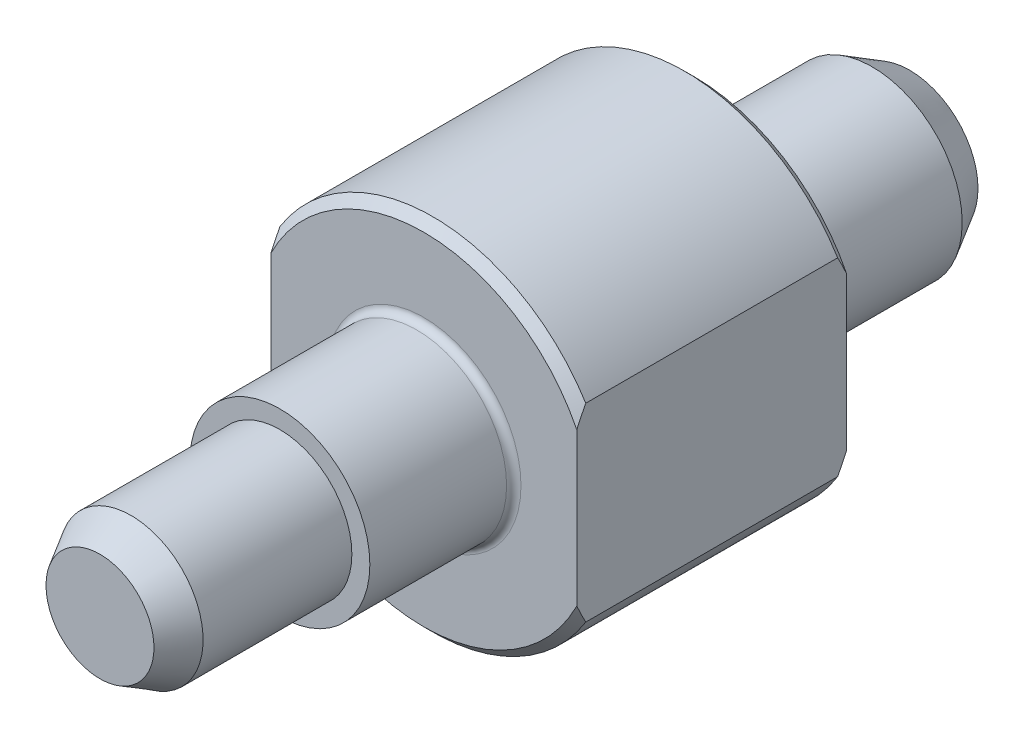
ISO-10303-21;
HEADER;
FILE_DESCRIPTION(('STEP AP214'),'2;1');
FILE_NAME('part.step','',(''),(''),'','','');
FILE_SCHEMA(('AUTOMOTIVE_DESIGN { 1 0 10303 214 1 1 1 1 }'));
ENDSEC;
DATA;
#1=APPLICATION_CONTEXT('core data for automotive mechanical design processes');
#2=APPLICATION_PROTOCOL_DEFINITION('international standard','automotive_design',2000,#1);
#3=PRODUCT_CONTEXT('',#1,'mechanical');
#4=PRODUCT('Part','Part','',(#3));
#5=PRODUCT_RELATED_PRODUCT_CATEGORY('part','',(#4));
#6=PRODUCT_DEFINITION_FORMATION('','',#4);
#7=PRODUCT_DEFINITION_CONTEXT('part definition',#1,'design');
#8=PRODUCT_DEFINITION('design','',#6,#7);
#9=PRODUCT_DEFINITION_SHAPE('','',#8);
#10=(LENGTH_UNIT() NAMED_UNIT(*) SI_UNIT(.MILLI.,.METRE.));
#11=(NAMED_UNIT(*) PLANE_ANGLE_UNIT() SI_UNIT($,.RADIAN.));
#12=(NAMED_UNIT(*) SI_UNIT($,.STERADIAN.) SOLID_ANGLE_UNIT());
#13=UNCERTAINTY_MEASURE_WITH_UNIT(LENGTH_MEASURE(1.E-05),#10,'distance_accuracy_value','');
#14=(GEOMETRIC_REPRESENTATION_CONTEXT(3) GLOBAL_UNCERTAINTY_ASSIGNED_CONTEXT((#13)) GLOBAL_UNIT_ASSIGNED_CONTEXT((#10,
#11,#12)) REPRESENTATION_CONTEXT('',''));
#15=CARTESIAN_POINT('',(0.,0.,0.));
#16=DIRECTION('',(0.,0.,1.));
#17=DIRECTION('',(1.,0.,0.));
#18=AXIS2_PLACEMENT_3D('',#15,#16,#17);
#19=CARTESIAN_POINT('',(0.,0.,0.));
#20=DIRECTION('',(0.,0.,1.));
#21=DIRECTION('',(1.,0.,0.));
#22=AXIS2_PLACEMENT_3D('',#19,#20,#21);
#23=PLANE('',#22);
#24=CARTESIAN_POINT('',(0.,0.,0.));
#25=DIRECTION('',(0.,0.,1.));
#26=DIRECTION('',(1.,0.,0.));
#27=AXIS2_PLACEMENT_3D('',#24,#25,#26);
#28=CIRCLE('',#27,5.4);
#29=CARTESIAN_POINT('',(5.4,0.,0.));
#30=VERTEX_POINT('',#29);
#31=EDGE_CURVE('E190',#30,#30,#28,.T.);
#32=ORIENTED_EDGE('',*,*,#31,.T.);
#33=EDGE_LOOP('',(#32));
#34=FACE_BOUND('',#33,.T.);
#35=DIRECTION('',(0.,-1.,0.));
#36=VECTOR('',#35,1.);
#37=CARTESIAN_POINT('',(8.5,0.,0.));
#38=LINE('',#37,#36);
#39=CARTESIAN_POINT('',(8.5,4.24264068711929,0.));
#40=VERTEX_POINT('',#39);
#41=CARTESIAN_POINT('',(8.5,-4.2426406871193,0.));
#42=VERTEX_POINT('',#41);
#43=EDGE_CURVE('E259',#40,#42,#38,.T.);
#44=ORIENTED_EDGE('',*,*,#43,.T.);
#45=CARTESIAN_POINT('',(0.,0.,0.));
#46=DIRECTION('',(0.,0.,1.));
#47=DIRECTION('',(1.,0.,0.));
#48=AXIS2_PLACEMENT_3D('',#45,#46,#47);
#49=CIRCLE('',#48,9.5);
#50=CARTESIAN_POINT('',(-8.5,-4.24264068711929,0.));
#51=VERTEX_POINT('',#50);
#52=EDGE_CURVE('E428',#42,#51,#49,.F.);
#53=ORIENTED_EDGE('',*,*,#52,.T.);
#54=DIRECTION('',(0.,-1.,0.));
#55=VECTOR('',#54,1.);
#56=CARTESIAN_POINT('',(-8.5,0.,0.));
#57=LINE('',#56,#55);
#58=CARTESIAN_POINT('',(-8.5,4.24264068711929,0.));
#59=VERTEX_POINT('',#58);
#60=EDGE_CURVE('E87',#59,#51,#57,.T.);
#61=ORIENTED_EDGE('',*,*,#60,.F.);
#62=CARTESIAN_POINT('',(0.,0.,0.));
#63=DIRECTION('',(0.,0.,1.));
#64=DIRECTION('',(1.,0.,0.));
#65=AXIS2_PLACEMENT_3D('',#62,#63,#64);
#66=CIRCLE('',#65,9.5);
#67=EDGE_CURVE('E427',#59,#40,#66,.F.);
#68=ORIENTED_EDGE('',*,*,#67,.T.);
#69=EDGE_LOOP('',(#44,#53,#61,#68));
#70=FACE_BOUND('',#69,.T.);
#71=ADVANCED_FACE('F14',(#34,#70),#23,.F.);
#72=CARTESIAN_POINT('',(0.,0.,15.));
#73=DIRECTION('',(0.,0.,-1.));
#74=DIRECTION('',(-1.,0.,0.));
#75=AXIS2_PLACEMENT_3D('',#72,#73,#74);
#76=CYLINDRICAL_SURFACE('',#75,10.);
#77=DIRECTION('',(0.,0.,1.));
#78=VECTOR('',#77,1.);
#79=CARTESIAN_POINT('',(8.5,5.26782687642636,-12.));
#80=LINE('',#79,#78);
#81=CARTESIAN_POINT('',(8.5,5.26782687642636,0.5));
#82=VERTEX_POINT('',#81);
#83=CARTESIAN_POINT('',(8.5,5.26782687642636,14.5));
#84=VERTEX_POINT('',#83);
#85=EDGE_CURVE('E266',#82,#84,#80,.T.);
#86=ORIENTED_EDGE('',*,*,#85,.F.);
#87=CARTESIAN_POINT('',(0.,0.,0.5));
#88=DIRECTION('',(0.,0.,1.));
#89=DIRECTION('',(1.,0.,0.));
#90=AXIS2_PLACEMENT_3D('',#87,#88,#89);
#91=CIRCLE('',#90,10.);
#92=CARTESIAN_POINT('',(-8.5,5.26782687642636,0.5));
#93=VERTEX_POINT('',#92);
#94=EDGE_CURVE('E188',#82,#93,#91,.T.);
#95=ORIENTED_EDGE('',*,*,#94,.T.);
#96=DIRECTION('',(0.,0.,1.));
#97=VECTOR('',#96,1.);
#98=CARTESIAN_POINT('',(-8.5,5.26782687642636,-12.));
#99=LINE('',#98,#97);
#100=CARTESIAN_POINT('',(-8.5,5.26782687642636,14.5));
#101=VERTEX_POINT('',#100);
#102=EDGE_CURVE('E102',#93,#101,#99,.T.);
#103=ORIENTED_EDGE('',*,*,#102,.T.);
#104=CARTESIAN_POINT('',(0.,0.,14.5));
#105=DIRECTION('',(0.,0.,1.));
#106=DIRECTION('',(1.,0.,0.));
#107=AXIS2_PLACEMENT_3D('',#104,#105,#106);
#108=CIRCLE('',#107,10.);
#109=EDGE_CURVE('E186',#101,#84,#108,.F.);
#110=ORIENTED_EDGE('',*,*,#109,.T.);
#111=EDGE_LOOP('',(#86,#95,#103,#110));
#112=FACE_BOUND('',#111,.T.);
#113=ADVANCED_FACE('F215',(#112),#76,.T.);
#114=DIRECTION('',(0.,0.,1.));
#115=VECTOR('',#114,1.);
#116=CARTESIAN_POINT('',(-8.5,-5.26782687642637,-12.));
#117=LINE('',#116,#115);
#118=CARTESIAN_POINT('',(-8.5,-5.26782687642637,0.5));
#119=VERTEX_POINT('',#118);
#120=CARTESIAN_POINT('',(-8.5,-5.26782687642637,14.5));
#121=VERTEX_POINT('',#120);
#122=EDGE_CURVE('E84',#119,#121,#117,.T.);
#123=ORIENTED_EDGE('',*,*,#122,.F.);
#124=CARTESIAN_POINT('',(0.,0.,0.5));
#125=DIRECTION('',(0.,0.,1.));
#126=DIRECTION('',(1.,0.,0.));
#127=AXIS2_PLACEMENT_3D('',#124,#125,#126);
#128=CIRCLE('',#127,10.);
#129=CARTESIAN_POINT('',(8.5,-5.26782687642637,0.5));
#130=VERTEX_POINT('',#129);
#131=EDGE_CURVE('E98',#119,#130,#128,.T.);
#132=ORIENTED_EDGE('',*,*,#131,.T.);
#133=DIRECTION('',(0.,0.,1.));
#134=VECTOR('',#133,1.);
#135=CARTESIAN_POINT('',(8.5,-5.26782687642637,-12.));
#136=LINE('',#135,#134);
#137=CARTESIAN_POINT('',(8.5,-5.26782687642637,14.5));
#138=VERTEX_POINT('',#137);
#139=EDGE_CURVE('E262',#130,#138,#136,.T.);
#140=ORIENTED_EDGE('',*,*,#139,.T.);
#141=CARTESIAN_POINT('',(0.,0.,14.5));
#142=DIRECTION('',(0.,0.,1.));
#143=DIRECTION('',(1.,0.,0.));
#144=AXIS2_PLACEMENT_3D('',#141,#142,#143);
#145=CIRCLE('',#144,10.);
#146=EDGE_CURVE('E101',#138,#121,#145,.F.);
#147=ORIENTED_EDGE('',*,*,#146,.T.);
#148=EDGE_LOOP('',(#123,#132,#140,#147));
#149=FACE_BOUND('',#148,.T.);
#150=ADVANCED_FACE('F96',(#149),#76,.T.);
#151=CARTESIAN_POINT('',(0.,0.,15.));
#152=DIRECTION('',(0.,0.,1.));
#153=DIRECTION('',(1.,0.,0.));
#154=AXIS2_PLACEMENT_3D('',#151,#152,#153);
#155=PLANE('',#154);
#156=CARTESIAN_POINT('',(0.,0.,15.));
#157=DIRECTION('',(0.,0.,1.));
#158=DIRECTION('',(1.,0.,0.));
#159=AXIS2_PLACEMENT_3D('',#156,#157,#158);
#160=CIRCLE('',#159,5.4);
#161=CARTESIAN_POINT('',(5.4,0.,15.));
#162=VERTEX_POINT('',#161);
#163=EDGE_CURVE('E9',#162,#162,#160,.F.);
#164=ORIENTED_EDGE('',*,*,#163,.T.);
#165=EDGE_LOOP('',(#164));
#166=FACE_BOUND('',#165,.T.);
#167=DIRECTION('',(0.,-1.,0.));
#168=VECTOR('',#167,1.);
#169=CARTESIAN_POINT('',(-8.5,5.26782687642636,15.));
#170=LINE('',#169,#168);
#171=CARTESIAN_POINT('',(-8.5,4.24264068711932,15.));
#172=VERTEX_POINT('',#171);
#173=CARTESIAN_POINT('',(-8.5,-4.24264068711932,15.));
#174=VERTEX_POINT('',#173);
#175=EDGE_CURVE('E103',#172,#174,#170,.T.);
#176=ORIENTED_EDGE('',*,*,#175,.T.);
#177=CARTESIAN_POINT('',(0.,0.,15.));
#178=DIRECTION('',(0.,0.,1.));
#179=DIRECTION('',(1.,0.,0.));
#180=AXIS2_PLACEMENT_3D('',#177,#178,#179);
#181=CIRCLE('',#180,9.5);
#182=CARTESIAN_POINT('',(8.5,-4.24264068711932,15.));
#183=VERTEX_POINT('',#182);
#184=EDGE_CURVE('E183',#174,#183,#181,.T.);
#185=ORIENTED_EDGE('',*,*,#184,.T.);
#186=DIRECTION('',(0.,-1.,0.));
#187=VECTOR('',#186,1.);
#188=CARTESIAN_POINT('',(8.5,5.26782687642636,15.));
#189=LINE('',#188,#187);
#190=CARTESIAN_POINT('',(8.5,4.24264068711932,15.));
#191=VERTEX_POINT('',#190);
#192=EDGE_CURVE('E269',#191,#183,#189,.T.);
#193=ORIENTED_EDGE('',*,*,#192,.F.);
#194=CARTESIAN_POINT('',(0.,0.,15.));
#195=DIRECTION('',(0.,0.,1.));
#196=DIRECTION('',(1.,0.,0.));
#197=AXIS2_PLACEMENT_3D('',#194,#195,#196);
#198=CIRCLE('',#197,9.5);
#199=EDGE_CURVE('E91',#191,#172,#198,.T.);
#200=ORIENTED_EDGE('',*,*,#199,.T.);
#201=EDGE_LOOP('',(#176,#185,#193,#200));
#202=FACE_BOUND('',#201,.T.);
#203=ADVANCED_FACE('F228',(#166,#202),#155,.T.);
#204=CARTESIAN_POINT('',(0.,0.,0.));
#205=DIRECTION('',(0.,0.,-1.));
#206=DIRECTION('',(-1.,0.,0.));
#207=AXIS2_PLACEMENT_3D('',#204,#205,#206);
#208=CYLINDRICAL_SURFACE('',#207,5.);
#209=CARTESIAN_POINT('',(0.,0.,-9.92153903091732));
#210=DIRECTION('',(0.,0.,1.));
#211=DIRECTION('',(1.,0.,0.));
#212=AXIS2_PLACEMENT_3D('',#209,#210,#211);
#213=CIRCLE('',#212,5.);
#214=CARTESIAN_POINT('',(5.,0.,-9.92153903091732));
#215=VERTEX_POINT('',#214);
#216=EDGE_CURVE('E282',#215,#215,#213,.T.);
#217=ORIENTED_EDGE('',*,*,#216,.T.);
#218=EDGE_LOOP('',(#217));
#219=FACE_BOUND('',#218,.T.);
#220=CARTESIAN_POINT('',(0.,0.,-0.4));
#221=DIRECTION('',(0.,0.,1.));
#222=DIRECTION('',(1.,0.,0.));
#223=AXIS2_PLACEMENT_3D('',#220,#221,#222);
#224=CIRCLE('',#223,5.);
#225=CARTESIAN_POINT('',(5.,0.,-0.4));
#226=VERTEX_POINT('',#225);
#227=EDGE_CURVE('E193',#226,#226,#224,.F.);
#228=ORIENTED_EDGE('',*,*,#227,.T.);
#229=EDGE_LOOP('',(#228));
#230=FACE_BOUND('',#229,.T.);
#231=ADVANCED_FACE('F230',(#219,#230),#208,.T.);
#232=CARTESIAN_POINT('',(0.,0.,23.));
#233=DIRECTION('',(0.,0.,-1.));
#234=DIRECTION('',(-1.,0.,0.));
#235=AXIS2_PLACEMENT_3D('',#232,#233,#234);
#236=CYLINDRICAL_SURFACE('',#235,5.);
#237=CARTESIAN_POINT('',(0.,0.,15.4));
#238=DIRECTION('',(0.,0.,1.));
#239=DIRECTION('',(1.,0.,0.));
#240=AXIS2_PLACEMENT_3D('',#237,#238,#239);
#241=CIRCLE('',#240,5.);
#242=CARTESIAN_POINT('',(5.,0.,15.4));
#243=VERTEX_POINT('',#242);
#244=EDGE_CURVE('E22',#243,#243,#241,.T.);
#245=ORIENTED_EDGE('',*,*,#244,.T.);
#246=EDGE_LOOP('',(#245));
#247=FACE_BOUND('',#246,.T.);
#248=CARTESIAN_POINT('',(0.,0.,23.));
#249=DIRECTION('',(0.,0.,1.));
#250=DIRECTION('',(1.,0.,0.));
#251=AXIS2_PLACEMENT_3D('',#248,#249,#250);
#252=CIRCLE('',#251,5.);
#253=CARTESIAN_POINT('',(5.,0.,23.));
#254=VERTEX_POINT('',#253);
#255=EDGE_CURVE('E258',#254,#254,#252,.T.);
#256=ORIENTED_EDGE('',*,*,#255,.F.);
#257=EDGE_LOOP('',(#256));
#258=FACE_BOUND('',#257,.T.);
#259=ADVANCED_FACE('F198',(#247,#258),#236,.T.);
#260=CARTESIAN_POINT('',(0.,0.,23.));
#261=DIRECTION('',(0.,0.,1.));
#262=DIRECTION('',(1.,0.,0.));
#263=AXIS2_PLACEMENT_3D('',#260,#261,#262);
#264=PLANE('',#263);
#265=CARTESIAN_POINT('',(0.,0.,23.));
#266=DIRECTION('',(0.,0.,1.));
#267=DIRECTION('',(1.,0.,0.));
#268=AXIS2_PLACEMENT_3D('',#265,#266,#267);
#269=CIRCLE('',#268,4.);
#270=CARTESIAN_POINT('',(4.,0.,23.));
#271=VERTEX_POINT('',#270);
#272=EDGE_CURVE('E111',#271,#271,#269,.T.);
#273=ORIENTED_EDGE('',*,*,#272,.F.);
#274=EDGE_LOOP('',(#273));
#275=FACE_BOUND('',#274,.T.);
#276=ORIENTED_EDGE('',*,*,#255,.T.);
#277=EDGE_LOOP('',(#276));
#278=FACE_BOUND('',#277,.T.);
#279=ADVANCED_FACE('F239',(#275,#278),#264,.T.);
#280=CARTESIAN_POINT('',(0.,0.,33.));
#281=DIRECTION('',(0.,0.,-1.));
#282=DIRECTION('',(-1.,0.,0.));
#283=AXIS2_PLACEMENT_3D('',#280,#281,#282);
#284=CYLINDRICAL_SURFACE('',#283,4.);
#285=CARTESIAN_POINT('',(0.,0.,31.2679491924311));
#286=DIRECTION('',(0.,0.,-1.));
#287=DIRECTION('',(-1.,0.,0.));
#288=AXIS2_PLACEMENT_3D('',#285,#286,#287);
#289=CIRCLE('',#288,4.);
#290=CARTESIAN_POINT('',(-4.,0.,31.2679491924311));
#291=VERTEX_POINT('',#290);
#292=EDGE_CURVE('E276',#291,#291,#289,.T.);
#293=ORIENTED_EDGE('',*,*,#292,.T.);
#294=EDGE_LOOP('',(#293));
#295=FACE_BOUND('',#294,.T.);
#296=ORIENTED_EDGE('',*,*,#272,.T.);
#297=EDGE_LOOP('',(#296));
#298=FACE_BOUND('',#297,.T.);
#299=ADVANCED_FACE('F134',(#295,#298),#284,.T.);
#300=CARTESIAN_POINT('',(8.5,5.26782687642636,-12.));
#301=DIRECTION('',(-1.,0.,0.));
#302=DIRECTION('',(0.,-1.,0.));
#303=AXIS2_PLACEMENT_3D('',#300,#301,#302);
#304=PLANE('',#303);
#305=ORIENTED_EDGE('',*,*,#139,.F.);
#306=CARTESIAN_POINT('',(8.5,-5.26782687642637,0.5));
#307=CARTESIAN_POINT('',(8.5,-5.18370592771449,0.455687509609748));
#308=CARTESIAN_POINT('',(8.5,-5.09926830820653,0.411973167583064));
#309=CARTESIAN_POINT('',(8.5,-4.92976096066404,0.325844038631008));
#310=CARTESIAN_POINT('',(8.5,-4.84469140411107,0.283428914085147));
#311=CARTESIAN_POINT('',(8.5,-4.67387549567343,0.199977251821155));
#312=CARTESIAN_POINT('',(8.5,-4.58812912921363,0.158940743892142));
#313=CARTESIAN_POINT('',(8.5,-4.41592077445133,0.0783385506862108));
#314=CARTESIAN_POINT('',(8.5,-4.32945860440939,0.0387732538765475));
#315=CARTESIAN_POINT('',(8.5,-4.2426406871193,0.));
#316=B_SPLINE_CURVE_WITH_KNOTS('',3,(#306,#307,#308,#309,#310,#311,#312,#313,#314,#315),
.UNSPECIFIED.,.F.,.F.,(4,2,2,2,4),(0.,0.285235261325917,0.570395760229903,0.855562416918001,
1.14080384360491),.UNSPECIFIED.);
#317=EDGE_CURVE('E106',#130,#42,#316,.T.);
#318=ORIENTED_EDGE('',*,*,#317,.T.);
#319=ORIENTED_EDGE('',*,*,#43,.F.);
#320=CARTESIAN_POINT('',(8.5,4.24264068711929,0.));
#321=CARTESIAN_POINT('',(8.5,4.32945860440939,0.038773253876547));
#322=CARTESIAN_POINT('',(8.5,4.41592077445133,0.0783385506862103));
#323=CARTESIAN_POINT('',(8.5,4.58812912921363,0.158940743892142));
#324=CARTESIAN_POINT('',(8.5,4.67387549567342,0.199977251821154));
#325=CARTESIAN_POINT('',(8.5,4.84469140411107,0.283428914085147));
#326=CARTESIAN_POINT('',(8.5,4.92976096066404,0.325844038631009));
#327=CARTESIAN_POINT('',(8.5,5.09926830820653,0.411973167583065));
#328=CARTESIAN_POINT('',(8.5,5.18370592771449,0.455687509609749));
#329=CARTESIAN_POINT('',(8.5,5.26782687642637,0.5));
#330=B_SPLINE_CURVE_WITH_KNOTS('',3,(#320,#321,#322,#323,#324,#325,#326,#327,#328,#329),
.UNSPECIFIED.,.F.,.F.,(4,2,2,2,4),(0.,0.285241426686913,0.57040808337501,0.855568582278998,
1.14080384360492),.UNSPECIFIED.);
#331=EDGE_CURVE('E109',#40,#82,#330,.T.);
#332=ORIENTED_EDGE('',*,*,#331,.T.);
#333=ORIENTED_EDGE('',*,*,#85,.T.);
#334=CARTESIAN_POINT('',(8.5,5.26782687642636,14.5));
#335=CARTESIAN_POINT('',(8.5,5.18370592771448,14.5443124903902));
#336=CARTESIAN_POINT('',(8.5,5.09926830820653,14.5880268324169));
#337=CARTESIAN_POINT('',(8.5,4.92976096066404,14.674155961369));
#338=CARTESIAN_POINT('',(8.5,4.84469140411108,14.7165710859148));
#339=CARTESIAN_POINT('',(8.5,4.67387549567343,14.8000227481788));
#340=CARTESIAN_POINT('',(8.5,4.58812912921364,14.8410592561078));
#341=CARTESIAN_POINT('',(8.5,4.41592077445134,14.9216614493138));
#342=CARTESIAN_POINT('',(8.5,4.32945860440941,14.9612267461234));
#343=CARTESIAN_POINT('',(8.5,4.24264068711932,15.));
#344=B_SPLINE_CURVE_WITH_KNOTS('',3,(#334,#335,#336,#337,#338,#339,#340,#341,#342,#343),
.UNSPECIFIED.,.F.,.F.,(4,2,2,2,4),(0.,0.28523526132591,0.570395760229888,0.855562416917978,
1.14080384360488),.UNSPECIFIED.);
#345=EDGE_CURVE('E107',#84,#191,#344,.T.);
#346=ORIENTED_EDGE('',*,*,#345,.T.);
#347=ORIENTED_EDGE('',*,*,#192,.T.);
#348=CARTESIAN_POINT('',(8.5,-4.24264068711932,15.));
#349=CARTESIAN_POINT('',(8.5,-4.32945860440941,14.9612267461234));
#350=CARTESIAN_POINT('',(8.5,-4.41592077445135,14.9216614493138));
#351=CARTESIAN_POINT('',(8.5,-4.58812912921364,14.8410592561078));
#352=CARTESIAN_POINT('',(8.5,-4.67387549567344,14.8000227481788));
#353=CARTESIAN_POINT('',(8.5,-4.84469140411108,14.7165710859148));
#354=CARTESIAN_POINT('',(8.5,-4.92976096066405,14.674155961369));
#355=CARTESIAN_POINT('',(8.5,-5.09926830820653,14.5880268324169));
#356=CARTESIAN_POINT('',(8.5,-5.18370592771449,14.5443124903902));
#357=CARTESIAN_POINT('',(8.5,-5.26782687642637,14.5));
#358=B_SPLINE_CURVE_WITH_KNOTS('',3,(#348,#349,#350,#351,#352,#353,#354,#355,#356,#357),
.UNSPECIFIED.,.F.,.F.,(4,2,2,2,4),(0.,0.285241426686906,0.570408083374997,0.855568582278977,
1.14080384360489),.UNSPECIFIED.);
#359=EDGE_CURVE('E144',#183,#138,#358,.T.);
#360=ORIENTED_EDGE('',*,*,#359,.T.);
#361=EDGE_LOOP('',(#305,#318,#319,#332,#333,#346,#347,#360));
#362=FACE_BOUND('',#361,.T.);
#363=ADVANCED_FACE('F129',(#362),#304,.F.);
#364=CARTESIAN_POINT('',(-8.5,5.26782687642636,-12.));
#365=DIRECTION('',(-1.,0.,0.));
#366=DIRECTION('',(0.,0.,1.));
#367=AXIS2_PLACEMENT_3D('',#364,#365,#366);
#368=PLANE('',#367);
#369=ORIENTED_EDGE('',*,*,#60,.T.);
#370=CARTESIAN_POINT('',(-8.5,-4.24264068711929,0.));
#371=CARTESIAN_POINT('',(-8.5,-4.32945860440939,0.038773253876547));
#372=CARTESIAN_POINT('',(-8.5,-4.41592077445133,0.0783385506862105));
#373=CARTESIAN_POINT('',(-8.5,-4.58812912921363,0.158940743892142));
#374=CARTESIAN_POINT('',(-8.5,-4.67387549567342,0.199977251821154));
#375=CARTESIAN_POINT('',(-8.5,-4.84469140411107,0.283428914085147));
#376=CARTESIAN_POINT('',(-8.5,-4.92976096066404,0.325844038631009));
#377=CARTESIAN_POINT('',(-8.5,-5.09926830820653,0.411973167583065));
#378=CARTESIAN_POINT('',(-8.5,-5.18370592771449,0.455687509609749));
#379=CARTESIAN_POINT('',(-8.5,-5.26782687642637,0.5));
#380=B_SPLINE_CURVE_WITH_KNOTS('',3,(#370,#371,#372,#373,#374,#375,#376,#377,#378,#379),
.UNSPECIFIED.,.F.,.F.,(4,2,2,2,4),(0.,0.285241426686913,0.57040808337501,0.855568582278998,
1.14080384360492),.UNSPECIFIED.);
#381=EDGE_CURVE('E81',#51,#119,#380,.T.);
#382=ORIENTED_EDGE('',*,*,#381,.T.);
#383=ORIENTED_EDGE('',*,*,#122,.T.);
#384=CARTESIAN_POINT('',(-8.5,-5.26782687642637,14.5));
#385=CARTESIAN_POINT('',(-8.5,-5.18370592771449,14.5443124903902));
#386=CARTESIAN_POINT('',(-8.5,-5.09926830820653,14.5880268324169));
#387=CARTESIAN_POINT('',(-8.5,-4.92976096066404,14.674155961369));
#388=CARTESIAN_POINT('',(-8.5,-4.84469140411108,14.7165710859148));
#389=CARTESIAN_POINT('',(-8.5,-4.67387549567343,14.8000227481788));
#390=CARTESIAN_POINT('',(-8.5,-4.58812912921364,14.8410592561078));
#391=CARTESIAN_POINT('',(-8.5,-4.41592077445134,14.9216614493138));
#392=CARTESIAN_POINT('',(-8.5,-4.3294586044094,14.9612267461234));
#393=CARTESIAN_POINT('',(-8.5,-4.24264068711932,15.));
#394=B_SPLINE_CURVE_WITH_KNOTS('',3,(#384,#385,#386,#387,#388,#389,#390,#391,#392,#393),
.UNSPECIFIED.,.F.,.F.,(4,2,2,2,4),(0.,0.285235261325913,0.570395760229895,0.855562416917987,
1.14080384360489),.UNSPECIFIED.);
#395=EDGE_CURVE('E92',#121,#174,#394,.T.);
#396=ORIENTED_EDGE('',*,*,#395,.T.);
#397=ORIENTED_EDGE('',*,*,#175,.F.);
#398=CARTESIAN_POINT('',(-8.5,4.24264068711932,15.));
#399=CARTESIAN_POINT('',(-8.5,4.3294586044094,14.9612267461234));
#400=CARTESIAN_POINT('',(-8.5,4.41592077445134,14.9216614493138));
#401=CARTESIAN_POINT('',(-8.5,4.58812912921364,14.8410592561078));
#402=CARTESIAN_POINT('',(-8.5,4.67387549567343,14.8000227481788));
#403=CARTESIAN_POINT('',(-8.5,4.84469140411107,14.7165710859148));
#404=CARTESIAN_POINT('',(-8.5,4.92976096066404,14.674155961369));
#405=CARTESIAN_POINT('',(-8.5,5.09926830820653,14.5880268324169));
#406=CARTESIAN_POINT('',(-8.5,5.18370592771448,14.5443124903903));
#407=CARTESIAN_POINT('',(-8.5,5.26782687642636,14.5));
#408=B_SPLINE_CURVE_WITH_KNOTS('',3,(#398,#399,#400,#401,#402,#403,#404,#405,#406,#407),
.UNSPECIFIED.,.F.,.F.,(4,2,2,2,4),(0.,0.285241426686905,0.570408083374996,0.855568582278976,
1.14080384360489),.UNSPECIFIED.);
#409=EDGE_CURVE('E29',#172,#101,#408,.T.);
#410=ORIENTED_EDGE('',*,*,#409,.T.);
#411=ORIENTED_EDGE('',*,*,#102,.F.);
#412=CARTESIAN_POINT('',(-8.5,5.26782687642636,0.5));
#413=CARTESIAN_POINT('',(-8.5,5.18370592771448,0.455687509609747));
#414=CARTESIAN_POINT('',(-8.5,5.09926830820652,0.411973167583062));
#415=CARTESIAN_POINT('',(-8.5,4.92976096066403,0.325844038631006));
#416=CARTESIAN_POINT('',(-8.5,4.84469140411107,0.283428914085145));
#417=CARTESIAN_POINT('',(-8.5,4.67387549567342,0.199977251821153));
#418=CARTESIAN_POINT('',(-8.5,4.58812912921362,0.158940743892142));
#419=CARTESIAN_POINT('',(-8.5,4.41592077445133,0.0783385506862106));
#420=CARTESIAN_POINT('',(-8.5,4.32945860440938,0.0387732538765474));
#421=CARTESIAN_POINT('',(-8.5,4.24264068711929,0.));
#422=B_SPLINE_CURVE_WITH_KNOTS('',3,(#412,#413,#414,#415,#416,#417,#418,#419,#420,#421),
.UNSPECIFIED.,.F.,.F.,(4,2,2,2,4),(0.,0.285235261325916,0.570395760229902,0.855562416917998,
1.14080384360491),.UNSPECIFIED.);
#423=EDGE_CURVE('E37',#93,#59,#422,.T.);
#424=ORIENTED_EDGE('',*,*,#423,.T.);
#425=EDGE_LOOP('',(#369,#382,#383,#396,#397,#410,#411,#424));
#426=FACE_BOUND('',#425,.T.);
#427=ADVANCED_FACE('F83',(#426),#368,.T.);
#428=CARTESIAN_POINT('',(0.,0.,0.5));
#429=DIRECTION('',(0.,0.,1.));
#430=DIRECTION('',(1.,0.,0.));
#431=AXIS2_PLACEMENT_3D('',#428,#429,#430);
#432=CONICAL_SURFACE('',#431,10.,0.785398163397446);
#433=ORIENTED_EDGE('',*,*,#381,.F.);
#434=ORIENTED_EDGE('',*,*,#52,.F.);
#435=ORIENTED_EDGE('',*,*,#317,.F.);
#436=ORIENTED_EDGE('',*,*,#131,.F.);
#437=EDGE_LOOP('',(#433,#434,#435,#436));
#438=FACE_BOUND('',#437,.T.);
#439=ADVANCED_FACE('F105',(#438),#432,.T.);
#440=CARTESIAN_POINT('',(0.,0.,15.));
#441=DIRECTION('',(0.,0.,-1.));
#442=DIRECTION('',(-1.,0.,0.));
#443=AXIS2_PLACEMENT_3D('',#440,#441,#442);
#444=CONICAL_SURFACE('',#443,9.5,0.785398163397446);
#445=ORIENTED_EDGE('',*,*,#395,.F.);
#446=ORIENTED_EDGE('',*,*,#146,.F.);
#447=ORIENTED_EDGE('',*,*,#359,.F.);
#448=ORIENTED_EDGE('',*,*,#184,.F.);
#449=EDGE_LOOP('',(#445,#446,#447,#448));
#450=FACE_BOUND('',#449,.T.);
#451=ADVANCED_FACE('F156',(#450),#444,.T.);
#452=CARTESIAN_POINT('',(0.,0.,0.5));
#453=DIRECTION('',(0.,0.,1.));
#454=DIRECTION('',(1.,0.,0.));
#455=AXIS2_PLACEMENT_3D('',#452,#453,#454);
#456=CONICAL_SURFACE('',#455,10.,0.785398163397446);
#457=ORIENTED_EDGE('',*,*,#331,.F.);
#458=ORIENTED_EDGE('',*,*,#67,.F.);
#459=ORIENTED_EDGE('',*,*,#423,.F.);
#460=ORIENTED_EDGE('',*,*,#94,.F.);
#461=EDGE_LOOP('',(#457,#458,#459,#460));
#462=FACE_BOUND('',#461,.T.);
#463=ADVANCED_FACE('F159',(#462),#456,.T.);
#464=CARTESIAN_POINT('',(0.,0.,15.));
#465=DIRECTION('',(0.,0.,-1.));
#466=DIRECTION('',(-1.,0.,0.));
#467=AXIS2_PLACEMENT_3D('',#464,#465,#466);
#468=CONICAL_SURFACE('',#467,9.5,0.785398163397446);
#469=ORIENTED_EDGE('',*,*,#345,.F.);
#470=ORIENTED_EDGE('',*,*,#109,.F.);
#471=ORIENTED_EDGE('',*,*,#409,.F.);
#472=ORIENTED_EDGE('',*,*,#199,.F.);
#473=EDGE_LOOP('',(#469,#470,#471,#472));
#474=FACE_BOUND('',#473,.T.);
#475=ADVANCED_FACE('F127',(#474),#468,.T.);
#476=CARTESIAN_POINT('',(0.,0.,-0.4));
#477=DIRECTION('',(0.,0.,1.));
#478=DIRECTION('',(1.,0.,0.));
#479=AXIS2_PLACEMENT_3D('',#476,#477,#478);
#480=TOROIDAL_SURFACE('',#479,5.4,0.4);
#481=ORIENTED_EDGE('',*,*,#227,.F.);
#482=EDGE_LOOP('',(#481));
#483=FACE_BOUND('',#482,.T.);
#484=ORIENTED_EDGE('',*,*,#31,.F.);
#485=EDGE_LOOP('',(#484));
#486=FACE_BOUND('',#485,.T.);
#487=ADVANCED_FACE('F203',(#483,#486),#480,.F.);
#488=CARTESIAN_POINT('',(0.,0.,15.4));
#489=DIRECTION('',(0.,0.,1.));
#490=DIRECTION('',(1.,0.,0.));
#491=AXIS2_PLACEMENT_3D('',#488,#489,#490);
#492=TOROIDAL_SURFACE('',#491,5.4,0.4);
#493=ORIENTED_EDGE('',*,*,#163,.F.);
#494=EDGE_LOOP('',(#493));
#495=FACE_BOUND('',#494,.T.);
#496=ORIENTED_EDGE('',*,*,#244,.F.);
#497=EDGE_LOOP('',(#496));
#498=FACE_BOUND('',#497,.T.);
#499=ADVANCED_FACE('F16',(#495,#498),#492,.F.);
#500=CARTESIAN_POINT('',(0.,0.,33.));
#501=DIRECTION('',(0.,0.,-1.));
#502=DIRECTION('',(-1.,0.,0.));
#503=AXIS2_PLACEMENT_3D('',#500,#501,#502);
#504=CONICAL_SURFACE('',#503,3.,0.523598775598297);
#505=CARTESIAN_POINT('',(0.,0.,33.));
#506=DIRECTION('',(0.,0.,-1.));
#507=DIRECTION('',(-1.,0.,0.));
#508=AXIS2_PLACEMENT_3D('',#505,#506,#507);
#509=CIRCLE('',#508,3.);
#510=CARTESIAN_POINT('',(-3.,0.,33.));
#511=VERTEX_POINT('',#510);
#512=EDGE_CURVE('E279',#511,#511,#509,.T.);
#513=ORIENTED_EDGE('',*,*,#512,.T.);
#514=EDGE_LOOP('',(#513));
#515=FACE_BOUND('',#514,.T.);
#516=ORIENTED_EDGE('',*,*,#292,.F.);
#517=EDGE_LOOP('',(#516));
#518=FACE_BOUND('',#517,.T.);
#519=ADVANCED_FACE('F202',(#515,#518),#504,.T.);
#520=CARTESIAN_POINT('',(0.,0.,33.));
#521=DIRECTION('',(0.,0.,1.));
#522=DIRECTION('',(1.,0.,0.));
#523=AXIS2_PLACEMENT_3D('',#520,#521,#522);
#524=PLANE('',#523);
#525=ORIENTED_EDGE('',*,*,#512,.F.);
#526=EDGE_LOOP('',(#525));
#527=FACE_BOUND('',#526,.T.);
#528=ADVANCED_FACE('F138',(#527),#524,.T.);
#529=CARTESIAN_POINT('',(0.,0.,-7.87168532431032));
#530=DIRECTION('',(0.,0.,1.));
#531=DIRECTION('',(1.,0.,0.));
#532=AXIS2_PLACEMENT_3D('',#529,#530,#531);
#533=CONICAL_SURFACE('',#532,6.18348358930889,0.523598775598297);
#534=CARTESIAN_POINT('',(0.,0.,-12.));
#535=DIRECTION('',(0.,0.,-1.));
#536=DIRECTION('',(-1.,0.,0.));
#537=AXIS2_PLACEMENT_3D('',#534,#535,#536);
#538=CIRCLE('',#537,3.8);
#539=CARTESIAN_POINT('',(-3.8,0.,-12.));
#540=VERTEX_POINT('',#539);
#541=EDGE_CURVE('E284',#540,#540,#538,.T.);
#542=ORIENTED_EDGE('',*,*,#541,.F.);
#543=EDGE_LOOP('',(#542));
#544=FACE_BOUND('',#543,.T.);
#545=ORIENTED_EDGE('',*,*,#216,.F.);
#546=EDGE_LOOP('',(#545));
#547=FACE_BOUND('',#546,.T.);
#548=ADVANCED_FACE('F235',(#544,#547),#533,.T.);
#549=CARTESIAN_POINT('',(0.,0.,-12.));
#550=DIRECTION('',(0.,0.,1.));
#551=DIRECTION('',(1.,0.,0.));
#552=AXIS2_PLACEMENT_3D('',#549,#550,#551);
#553=PLANE('',#552);
#554=ORIENTED_EDGE('',*,*,#541,.T.);
#555=EDGE_LOOP('',(#554));
#556=FACE_BOUND('',#555,.T.);
#557=ADVANCED_FACE('F233',(#556),#553,.F.);
#558=CLOSED_SHELL('',(#71,#113,#150,#203,#231,#259,#279,#299,#363,#427,#439,#451,#463,#475,#487,
#499,#519,#528,#548,#557));
#559=MANIFOLD_SOLID_BREP('B1',#558);
#560=ADVANCED_BREP_SHAPE_REPRESENTATION('',(#18,#559),#14);
#561=SHAPE_DEFINITION_REPRESENTATION(#9,#560);
ENDSEC;
END-ISO-10303-21;
